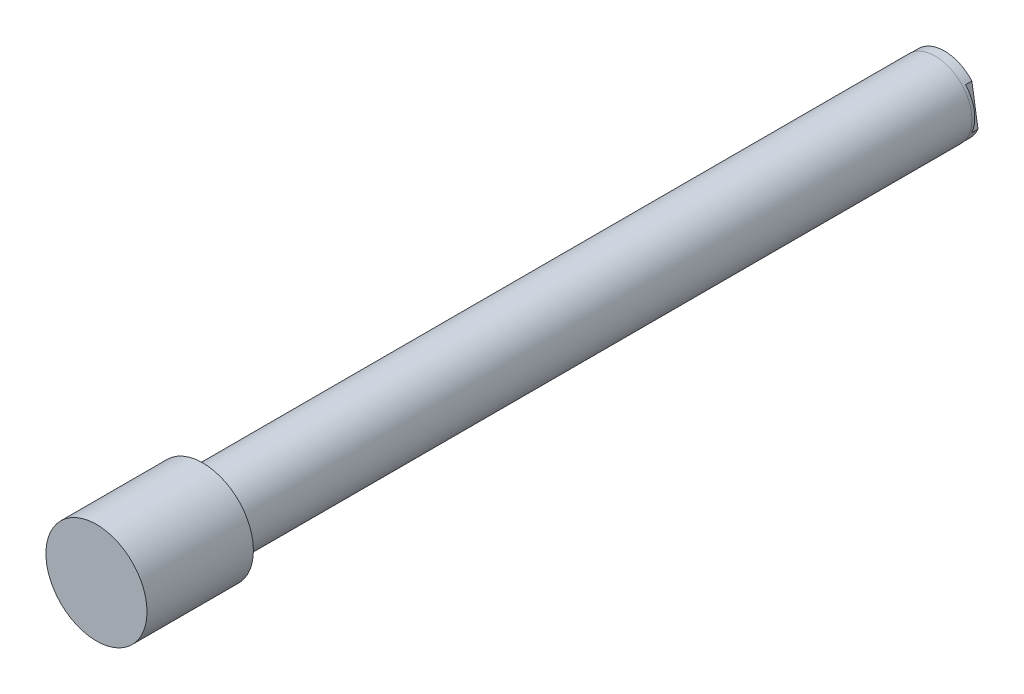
ISO-10303-21;
HEADER;
FILE_DESCRIPTION(('STEP AP214'),'2;1');
FILE_NAME('part.step','',(''),(''),'','','');
FILE_SCHEMA(('AUTOMOTIVE_DESIGN { 1 0 10303 214 1 1 1 1 }'));
ENDSEC;
DATA;
#1=APPLICATION_CONTEXT('core data for automotive mechanical design processes');
#2=APPLICATION_PROTOCOL_DEFINITION('international standard','automotive_design',2000,#1);
#3=PRODUCT_CONTEXT('',#1,'mechanical');
#4=PRODUCT('Part','Part','',(#3));
#5=PRODUCT_RELATED_PRODUCT_CATEGORY('part','',(#4));
#6=PRODUCT_DEFINITION_FORMATION('','',#4);
#7=PRODUCT_DEFINITION_CONTEXT('part definition',#1,'design');
#8=PRODUCT_DEFINITION('design','',#6,#7);
#9=PRODUCT_DEFINITION_SHAPE('','',#8);
#10=(LENGTH_UNIT() NAMED_UNIT(*) SI_UNIT(.MILLI.,.METRE.));
#11=(NAMED_UNIT(*) PLANE_ANGLE_UNIT() SI_UNIT($,.RADIAN.));
#12=(NAMED_UNIT(*) SI_UNIT($,.STERADIAN.) SOLID_ANGLE_UNIT());
#13=UNCERTAINTY_MEASURE_WITH_UNIT(LENGTH_MEASURE(1.E-05),#10,'distance_accuracy_value','');
#14=(GEOMETRIC_REPRESENTATION_CONTEXT(3) GLOBAL_UNCERTAINTY_ASSIGNED_CONTEXT((#13)) GLOBAL_UNIT_ASSIGNED_CONTEXT((#10,
#11,#12)) REPRESENTATION_CONTEXT('',''));
#15=CARTESIAN_POINT('',(0.,0.,0.));
#16=DIRECTION('',(0.,0.,1.));
#17=DIRECTION('',(1.,0.,0.));
#18=AXIS2_PLACEMENT_3D('',#15,#16,#17);
#19=CARTESIAN_POINT('',(0.,0.,29.21));
#20=DIRECTION('',(0.,0.,-1.));
#21=DIRECTION('',(0.156434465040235,-0.987688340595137,0.));
#22=AXIS2_PLACEMENT_3D('',#19,#20,#21);
#23=CONICAL_SURFACE('',#22,4.96062,1.02974425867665);
#24=CARTESIAN_POINT('',(0.,0.,32.1906412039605));
#25=VERTEX_POINT('',#24);
#26=VERTEX_LOOP('',#25);
#27=FACE_BOUND('',#26,.T.);
#28=CARTESIAN_POINT('',(0.,0.,29.21));
#29=DIRECTION('',(0.,0.,-1.));
#30=DIRECTION('',(0.156434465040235,-0.987688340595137,0.));
#31=AXIS2_PLACEMENT_3D('',#28,#29,#30);
#32=CIRCLE('',#31,4.96062);
#33=CARTESIAN_POINT('',(0.776011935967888,-4.89954653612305,29.21));
#34=VERTEX_POINT('',#33);
#35=EDGE_CURVE('E68',#34,#34,#32,.T.);
#36=ORIENTED_EDGE('',*,*,#35,.T.);
#37=EDGE_LOOP('',(#36));
#38=FACE_BOUND('',#37,.T.);
#39=ADVANCED_FACE('F16',(#27,#38),#23,.F.);
#40=CARTESIAN_POINT('',(0.,0.,2.54));
#41=DIRECTION('',(0.,0.,-1.));
#42=DIRECTION('',(0.156434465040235,-0.987688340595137,0.));
#43=AXIS2_PLACEMENT_3D('',#40,#41,#42);
#44=PLANE('',#43);
#45=DIRECTION('',(0.156434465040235,-0.987688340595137,0.));
#46=VECTOR('',#45,1.);
#47=CARTESIAN_POINT('',(11.1719712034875,9.83526424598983,2.54));
#48=LINE('',#47,#46);
#49=CARTESIAN_POINT('',(11.1719712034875,9.83526424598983,2.54));
#50=VERTEX_POINT('',#49);
#51=CARTESIAN_POINT('',(13.6644398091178,-5.90156318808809,2.54));
#52=VERTEX_POINT('',#51);
#53=EDGE_CURVE('E78',#50,#52,#48,.T.);
#54=ORIENTED_EDGE('',*,*,#53,.F.);
#55=CARTESIAN_POINT('',(0.,0.,2.54));
#56=DIRECTION('',(0.,0.,-1.));
#57=DIRECTION('',(0.156434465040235,-0.987688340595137,0.));
#58=AXIS2_PLACEMENT_3D('',#55,#56,#57);
#59=CIRCLE('',#58,14.8844);
#60=EDGE_CURVE('E10',#52,#50,#59,.F.);
#61=ORIENTED_EDGE('',*,*,#60,.F.);
#62=EDGE_LOOP('',(#54,#61));
#63=FACE_BOUND('',#62,.T.);
#64=ADVANCED_FACE('F64',(#63),#44,.T.);
#65=CARTESIAN_POINT('',(11.1719712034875,9.83526424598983,2.54));
#66=DIRECTION('',(0.987688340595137,0.156434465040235,0.));
#67=DIRECTION('',(0.,0.,1.));
#68=AXIS2_PLACEMENT_3D('',#65,#66,#67);
#69=PLANE('',#68);
#70=DIRECTION('',(0.156434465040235,-0.987688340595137,0.));
#71=VECTOR('',#70,1.);
#72=CARTESIAN_POINT('',(11.1719712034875,9.83526424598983,0.));
#73=LINE('',#72,#71);
#74=CARTESIAN_POINT('',(11.1719712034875,9.83526424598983,0.));
#75=VERTEX_POINT('',#74);
#76=CARTESIAN_POINT('',(13.6644398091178,-5.90156318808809,0.));
#77=VERTEX_POINT('',#76);
#78=EDGE_CURVE('E73',#75,#77,#73,.T.);
#79=ORIENTED_EDGE('',*,*,#78,.F.);
#80=DIRECTION('',(0.,0.,-1.));
#81=VECTOR('',#80,1.);
#82=CARTESIAN_POINT('',(11.1719712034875,9.83526424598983,2.54));
#83=LINE('',#82,#81);
#84=EDGE_CURVE('E83',#50,#75,#83,.T.);
#85=ORIENTED_EDGE('',*,*,#84,.F.);
#86=ORIENTED_EDGE('',*,*,#53,.T.);
#87=DIRECTION('',(0.,0.,-1.));
#88=VECTOR('',#87,1.);
#89=CARTESIAN_POINT('',(13.6644398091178,-5.90156318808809,2.54));
#90=LINE('',#89,#88);
#91=EDGE_CURVE('E33',#52,#77,#90,.T.);
#92=ORIENTED_EDGE('',*,*,#91,.T.);
#93=EDGE_LOOP('',(#79,#85,#86,#92));
#94=FACE_BOUND('',#93,.T.);
#95=ADVANCED_FACE('F161',(#94),#69,.T.);
#96=DIRECTION('',(-0.156434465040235,0.987688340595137,0.));
#97=VECTOR('',#96,1.);
#98=CARTESIAN_POINT('',(-13.6644398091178,5.90156318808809,2.54));
#99=LINE('',#98,#97);
#100=CARTESIAN_POINT('',(-11.1719712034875,-9.83526424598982,2.54));
#101=VERTEX_POINT('',#100);
#102=CARTESIAN_POINT('',(-13.6644398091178,5.90156318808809,2.54));
#103=VERTEX_POINT('',#102);
#104=EDGE_CURVE('E80',#101,#103,#99,.T.);
#105=ORIENTED_EDGE('',*,*,#104,.F.);
#106=EDGE_CURVE('E25',#103,#101,#59,.F.);
#107=ORIENTED_EDGE('',*,*,#106,.F.);
#108=EDGE_LOOP('',(#105,#107));
#109=FACE_BOUND('',#108,.T.);
#110=ADVANCED_FACE('F158',(#109),#44,.T.);
#111=CARTESIAN_POINT('',(-13.6644398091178,5.90156318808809,2.54));
#112=DIRECTION('',(-0.987688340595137,-0.156434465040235,0.));
#113=DIRECTION('',(0.,0.,-1.));
#114=AXIS2_PLACEMENT_3D('',#111,#112,#113);
#115=PLANE('',#114);
#116=DIRECTION('',(-0.156434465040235,0.987688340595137,0.));
#117=VECTOR('',#116,1.);
#118=CARTESIAN_POINT('',(-13.6644398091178,5.90156318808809,0.));
#119=LINE('',#118,#117);
#120=CARTESIAN_POINT('',(-11.1719712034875,-9.83526424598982,0.));
#121=VERTEX_POINT('',#120);
#122=CARTESIAN_POINT('',(-13.6644398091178,5.90156318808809,0.));
#123=VERTEX_POINT('',#122);
#124=EDGE_CURVE('E81',#121,#123,#119,.T.);
#125=ORIENTED_EDGE('',*,*,#124,.F.);
#126=DIRECTION('',(0.,0.,-1.));
#127=VECTOR('',#126,1.);
#128=CARTESIAN_POINT('',(-11.1719712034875,-9.83526424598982,2.54));
#129=LINE('',#128,#127);
#130=EDGE_CURVE('E88',#101,#121,#129,.T.);
#131=ORIENTED_EDGE('',*,*,#130,.F.);
#132=ORIENTED_EDGE('',*,*,#104,.T.);
#133=DIRECTION('',(0.,0.,-1.));
#134=VECTOR('',#133,1.);
#135=CARTESIAN_POINT('',(-13.6644398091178,5.90156318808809,2.54));
#136=LINE('',#135,#134);
#137=EDGE_CURVE('E41',#103,#123,#136,.T.);
#138=ORIENTED_EDGE('',*,*,#137,.T.);
#139=EDGE_LOOP('',(#125,#131,#132,#138));
#140=FACE_BOUND('',#139,.T.);
#141=ADVANCED_FACE('F156',(#140),#115,.T.);
#142=CARTESIAN_POINT('',(0.,0.,0.));
#143=DIRECTION('',(0.,0.,-1.));
#144=DIRECTION('',(0.156434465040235,-0.987688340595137,0.));
#145=AXIS2_PLACEMENT_3D('',#142,#143,#144);
#146=PLANE('',#145);
#147=CARTESIAN_POINT('',(0.,0.,0.));
#148=DIRECTION('',(0.,0.,-1.));
#149=DIRECTION('',(0.156434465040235,-0.987688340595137,0.));
#150=AXIS2_PLACEMENT_3D('',#147,#148,#149);
#151=CIRCLE('',#150,4.96062);
#152=CARTESIAN_POINT('',(0.776011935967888,-4.89954653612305,0.));
#153=VERTEX_POINT('',#152);
#154=EDGE_CURVE('E70',#153,#153,#151,.T.);
#155=ORIENTED_EDGE('',*,*,#154,.F.);
#156=EDGE_LOOP('',(#155));
#157=FACE_BOUND('',#156,.T.);
#158=CARTESIAN_POINT('',(0.,0.,0.));
#159=DIRECTION('',(0.,0.,-1.));
#160=DIRECTION('',(0.156434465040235,-0.987688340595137,0.));
#161=AXIS2_PLACEMENT_3D('',#158,#159,#160);
#162=CIRCLE('',#161,14.8844);
#163=EDGE_CURVE('E96',#77,#121,#162,.T.);
#164=ORIENTED_EDGE('',*,*,#163,.T.);
#165=ORIENTED_EDGE('',*,*,#124,.T.);
#166=EDGE_CURVE('E98',#123,#75,#162,.T.);
#167=ORIENTED_EDGE('',*,*,#166,.T.);
#168=ORIENTED_EDGE('',*,*,#78,.T.);
#169=EDGE_LOOP('',(#164,#165,#167,#168));
#170=FACE_BOUND('',#169,.T.);
#171=ADVANCED_FACE('F149',(#157,#170),#146,.T.);
#172=CARTESIAN_POINT('',(0.,0.,0.));
#173=DIRECTION('',(0.,0.,-1.));
#174=DIRECTION('',(0.156434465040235,-0.987688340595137,0.));
#175=AXIS2_PLACEMENT_3D('',#172,#173,#174);
#176=CYLINDRICAL_SURFACE('',#175,4.96062);
#177=ORIENTED_EDGE('',*,*,#154,.T.);
#178=EDGE_LOOP('',(#177));
#179=FACE_BOUND('',#178,.T.);
#180=ORIENTED_EDGE('',*,*,#35,.F.);
#181=EDGE_LOOP('',(#180));
#182=FACE_BOUND('',#181,.T.);
#183=ADVANCED_FACE('F142',(#179,#182),#176,.F.);
#184=CARTESIAN_POINT('',(0.,0.,2.54));
#185=DIRECTION('',(0.,0.,-1.));
#186=DIRECTION('',(0.156434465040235,-0.987688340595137,0.));
#187=AXIS2_PLACEMENT_3D('',#184,#185,#186);
#188=CYLINDRICAL_SURFACE('',#187,14.8844);
#189=ORIENTED_EDGE('',*,*,#166,.F.);
#190=ORIENTED_EDGE('',*,*,#137,.F.);
#191=ORIENTED_EDGE('',*,*,#106,.T.);
#192=ORIENTED_EDGE('',*,*,#130,.T.);
#193=ORIENTED_EDGE('',*,*,#163,.F.);
#194=ORIENTED_EDGE('',*,*,#91,.F.);
#195=ORIENTED_EDGE('',*,*,#60,.T.);
#196=ORIENTED_EDGE('',*,*,#84,.T.);
#197=EDGE_LOOP('',(#189,#190,#191,#192,#193,#194,#195,#196));
#198=FACE_BOUND('',#197,.T.);
#199=CARTESIAN_POINT('',(0.,0.,3.81));
#200=DIRECTION('',(0.,0.,1.));
#201=DIRECTION('',(-0.156434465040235,0.987688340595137,0.));
#202=AXIS2_PLACEMENT_3D('',#199,#200,#201);
#203=CIRCLE('',#202,14.8844);
#204=CARTESIAN_POINT('',(-2.32843315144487,14.7011483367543,3.81));
#205=VERTEX_POINT('',#204);
#206=EDGE_CURVE('E87',#205,#205,#203,.T.);
#207=ORIENTED_EDGE('',*,*,#206,.F.);
#208=EDGE_LOOP('',(#207));
#209=FACE_BOUND('',#208,.T.);
#210=ADVANCED_FACE('F126',(#198,#209),#188,.T.);
#211=CARTESIAN_POINT('',(0.,0.,346.202));
#212=DIRECTION('',(0.,0.,1.));
#213=DIRECTION('',(1.,0.,0.));
#214=AXIS2_PLACEMENT_3D('',#211,#212,#213);
#215=PLANE('',#214);
#216=CARTESIAN_POINT('',(0.,0.,346.202));
#217=DIRECTION('',(0.,0.,1.));
#218=DIRECTION('',(1.,0.,0.));
#219=AXIS2_PLACEMENT_3D('',#216,#217,#218);
#220=CIRCLE('',#219,20.6375);
#221=CARTESIAN_POINT('',(20.6375,0.,346.202));
#222=VERTEX_POINT('',#221);
#223=EDGE_CURVE('E100',#222,#222,#220,.T.);
#224=ORIENTED_EDGE('',*,*,#223,.T.);
#225=EDGE_LOOP('',(#224));
#226=FACE_BOUND('',#225,.T.);
#227=ADVANCED_FACE('F118',(#226),#215,.T.);
#228=CARTESIAN_POINT('',(0.,0.,346.202));
#229=DIRECTION('',(0.,0.,-1.));
#230=DIRECTION('',(-1.,0.,0.));
#231=AXIS2_PLACEMENT_3D('',#228,#229,#230);
#232=CYLINDRICAL_SURFACE('',#231,20.6375);
#233=ORIENTED_EDGE('',*,*,#223,.F.);
#234=EDGE_LOOP('',(#233));
#235=FACE_BOUND('',#234,.T.);
#236=CARTESIAN_POINT('',(0.,0.,302.768));
#237=DIRECTION('',(0.,0.,1.));
#238=DIRECTION('',(1.,0.,0.));
#239=AXIS2_PLACEMENT_3D('',#236,#237,#238);
#240=CIRCLE('',#239,20.6375);
#241=CARTESIAN_POINT('',(20.6375,0.,302.768));
#242=VERTEX_POINT('',#241);
#243=EDGE_CURVE('E103',#242,#242,#240,.T.);
#244=ORIENTED_EDGE('',*,*,#243,.T.);
#245=EDGE_LOOP('',(#244));
#246=FACE_BOUND('',#245,.T.);
#247=ADVANCED_FACE('F112',(#235,#246),#232,.T.);
#248=CARTESIAN_POINT('',(0.,0.,302.768));
#249=DIRECTION('',(0.,0.,1.));
#250=DIRECTION('',(1.,0.,0.));
#251=AXIS2_PLACEMENT_3D('',#248,#249,#250);
#252=PLANE('',#251);
#253=CARTESIAN_POINT('',(0.,0.,302.768));
#254=DIRECTION('',(0.,0.,1.));
#255=DIRECTION('',(1.,0.,0.));
#256=AXIS2_PLACEMENT_3D('',#253,#254,#255);
#257=CIRCLE('',#256,14.9987);
#258=CARTESIAN_POINT('',(14.9987,0.,302.768));
#259=VERTEX_POINT('',#258);
#260=EDGE_CURVE('E76',#259,#259,#257,.F.);
#261=ORIENTED_EDGE('',*,*,#260,.F.);
#262=EDGE_LOOP('',(#261));
#263=FACE_BOUND('',#262,.T.);
#264=ORIENTED_EDGE('',*,*,#243,.F.);
#265=EDGE_LOOP('',(#264));
#266=FACE_BOUND('',#265,.T.);
#267=ADVANCED_FACE('F109',(#263,#266),#252,.F.);
#268=CARTESIAN_POINT('',(0.,0.,302.768));
#269=DIRECTION('',(0.,0.,-1.));
#270=DIRECTION('',(-1.,0.,0.));
#271=AXIS2_PLACEMENT_3D('',#268,#269,#270);
#272=CYLINDRICAL_SURFACE('',#271,14.9987);
#273=CARTESIAN_POINT('',(0.,0.,3.81));
#274=DIRECTION('',(0.,0.,-1.));
#275=DIRECTION('',(-1.,0.,0.));
#276=AXIS2_PLACEMENT_3D('',#273,#274,#275);
#277=CIRCLE('',#276,14.9987);
#278=CARTESIAN_POINT('',(-14.9987,0.,3.81));
#279=VERTEX_POINT('',#278);
#280=EDGE_CURVE('E20',#279,#279,#277,.T.);
#281=ORIENTED_EDGE('',*,*,#280,.F.);
#282=EDGE_LOOP('',(#281));
#283=FACE_BOUND('',#282,.T.);
#284=ORIENTED_EDGE('',*,*,#260,.T.);
#285=EDGE_LOOP('',(#284));
#286=FACE_BOUND('',#285,.T.);
#287=ADVANCED_FACE('F18',(#283,#286),#272,.T.);
#288=CARTESIAN_POINT('',(0.,0.,3.81));
#289=DIRECTION('',(0.,0.,-1.));
#290=DIRECTION('',(-1.,0.,0.));
#291=AXIS2_PLACEMENT_3D('',#288,#289,#290);
#292=PLANE('',#291);
#293=ORIENTED_EDGE('',*,*,#206,.T.);
#294=EDGE_LOOP('',(#293));
#295=FACE_BOUND('',#294,.T.);
#296=ORIENTED_EDGE('',*,*,#280,.T.);
#297=EDGE_LOOP('',(#296));
#298=FACE_BOUND('',#297,.T.);
#299=ADVANCED_FACE('F114',(#295,#298),#292,.T.);
#300=CLOSED_SHELL('',(#39,#64,#95,#110,#141,#171,#183,#210,#227,#247,#267,#287,#299));
#301=MANIFOLD_SOLID_BREP('B1',#300);
#302=ADVANCED_BREP_SHAPE_REPRESENTATION('',(#18,#301),#14);
#303=SHAPE_DEFINITION_REPRESENTATION(#9,#302);
ENDSEC;
END-ISO-10303-21;
